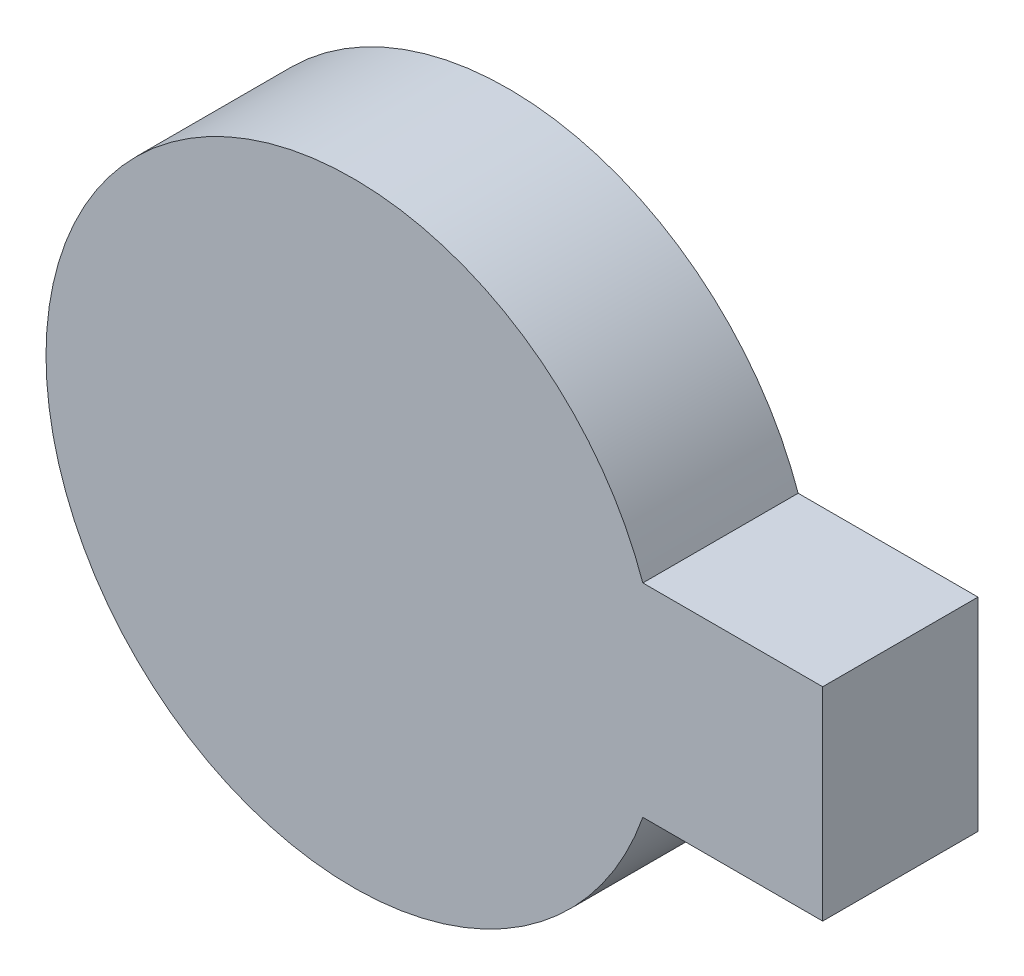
from build123d import *

# Parameters (mm, degrees)
BOSS_EXTRUDE1_DEPTH = 3.81


with BuildPart() as part:
    # Sketch1 → Boss-Extrude1 (new body)
    with BuildSketch(Plane.XY):
        with BuildLine():
            Line((11.5189, 2.4892), (7.107837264, 2.4892))
            ThreePointArc((7.107837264, 2.4892), (-7.5311, 0), (7.107837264, -2.4892))
            Line((7.107837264, -2.4892), (11.5189, -2.4892))
            Line((11.5189, -2.4892), (11.5189, 2.4892))
        make_face()
    extrude(amount=BOSS_EXTRUDE1_DEPTH)


solid = part.part
